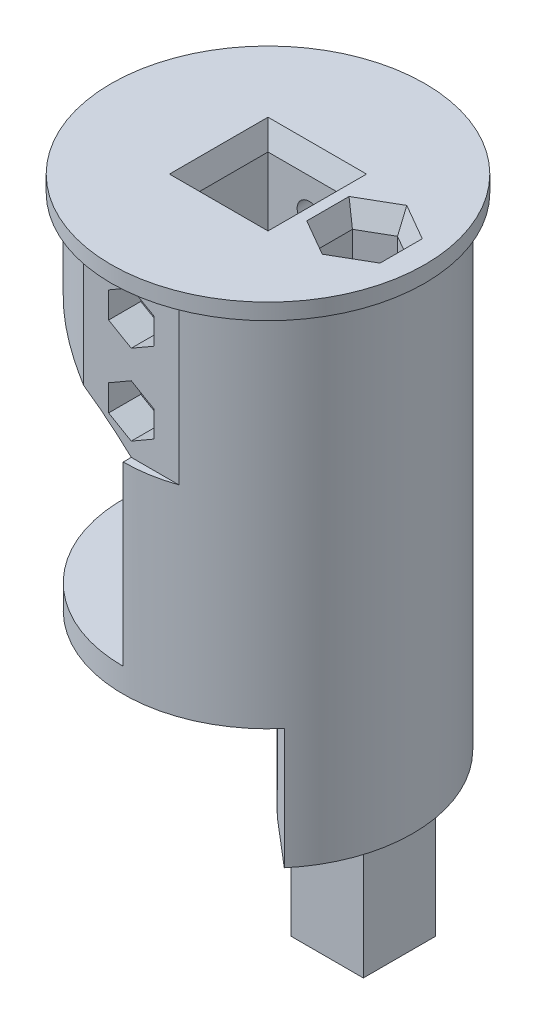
from build123d import *
from build123d.topology import SkipClean

# Parameters (mm, degrees)
SKETCH_1_R          = 18
EXTRUDE_1_DEPTH     = 45
SKETCH_2_R          = 19.5
EXTRUDE_2_DEPTH     = 2
SKETCH_3_W          = 10.25
SKETCH_3_H          = 10.25
CUT_EXTRUDE_1_DEPTH = 40
EXTRUDE_START       = 15
EXTRUDE_3_DEPTH     = 15
BOSS_EXTRUDE1_START = 20
SKETCH1_R           = 18
BOSS_EXTRUDE1_DEPTH = 20
BOSS_EXTRUDE2_START = 7
SKETCH3_R           = 18
BOSS_EXTRUDE2_DEPTH = 7
SKETCH4_W           = 10.2
SKETCH4_H           = 10.2
CUT_EXTRUDE2_DEPTH  = 27
CUT_EXTRUDE4_DEPTH  = 25
BOSS_EXTRUDE3_DEPTH = 3
SKETCH9_W           = 36
SKETCH9_H           = 22
CUT_EXTRUDE5_DEPTH  = 8
SKETCH10_R          = 3.7
SKETCH10_W          = 3
SKETCH10_H          = 2
CUT_EXTRUDE6_DEPTH  = 10
SKETCH11_R          = 2
CUT_EXTRUDE7_DEPTH  = 102
SKETCH15_R          = 18
CUT_EXTRUDE9_DEPTH  = 27
CUT_EXTRUDE11_DEPTH = 20
SKETCH18_R          = 1.5
CUT_EXTRUDE12_DEPTH = 63.62188116
SKETCH19_R          = 3
CUT_EXTRUDE13_DEPTH = 3
BOSS_EXTRUDE5_DEPTH = 22
CUT_EXTRUDE16_DEPTH = 4
CUT_EXTRUDE17_DEPTH = 6
CUT_EXTRUDE18_DEPTH = 63.62188116
FILLET2_R           = 5
SKETCH30_W          = 18.8
SKETCH30_H          = 10
CUT_EXTRUDE20_DEPTH = 3
CHAMFER1_SIZE       = 1
CHAMFER1_SIZE2      = 2.747477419
CHAMFER2_SIZE       = 1
CHAMFER2_SIZE2      = 2.747477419
BOSS_EXTRUDE7_START = 15
SKETCH37_W          = 9
SKETCH37_H          = 9
SKETCH37_R          = 2
BOSS_EXTRUDE7_DEPTH = 15
CUT_EXTRUDE22_DEPTH = 15
CUT_EXTRUDE23_REACH = 69.856
SKETCH40_W          = 4.363156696
SKETCH40_H          = 4.363156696
CUT_EXTRUDE24_DEPTH = 10
FILLET7_R           = 6


with BuildPart() as part:
    # Sketch 1 → Extrude 1 (new body)
    with BuildSketch(Plane(origin=(0, 0, 0), x_dir=(1, 0, 0), z_dir=(0, 1, 0))):
        with Locations(Location((0, 0, 0), (0, 0, 90))):
            Circle(SKETCH_1_R)
    extrude(amount=EXTRUDE_1_DEPTH)

    # Sketch 2 → Extrude 2 (add)
    with BuildSketch(Plane(origin=(0, 45, 0), x_dir=(1, 0, 0), z_dir=(0, 1, 0))):
        with Locations(Location((0, 0, 0), (0, 0, 270))):
            Circle(SKETCH_2_R)
    extrude(amount=EXTRUDE_2_DEPTH)

    # Sketch 3 → Cut-Extrude 1 (cut)
    with BuildSketch(Plane(origin=(0, 47, 0), x_dir=(1, 0, 0), z_dir=(0, 1, 0))):
        Rectangle(SKETCH_3_W, SKETCH_3_H)
    extrude(amount=-CUT_EXTRUDE_1_DEPTH, mode=Mode.SUBTRACT)

    # Sketch 4 → Extrude 3 (add)
    with BuildSketch(Plane.XZ.offset(EXTRUDE_START)):
        with BuildLine():
            Line((5.142300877, -6.128355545), (11.570176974, -13.788799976))
            ThreePointArc((11.570176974, -13.788799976), (17.937391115, -1.5), (13.69961987, 11.675633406))
            Line((13.69961987, 11.675633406), (5.142300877, 4.38257561))
            Line((5.142300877, 4.38257561), (5.142300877, -6.128355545))
        make_face()
    extrude(amount=-EXTRUDE_3_DEPTH)

    # Sketch1 → Boss-Extrude1 (add)
    with BuildSketch(Plane.XZ.offset(15).offset(BOSS_EXTRUDE1_START)):
        with Locations(Location((0, 0, 0), (0, 0, 270))):
            Circle(SKETCH1_R)
    extrude(amount=-BOSS_EXTRUDE1_DEPTH)

    # Sketch3 → Boss-Extrude2 (add)
    with BuildSketch(Plane.XZ.offset(35).offset(BOSS_EXTRUDE2_START)):
        with Locations(Location((0, 0, 0), (0, 0, 270))):
            Circle(SKETCH3_R)
    extrude(amount=-BOSS_EXTRUDE2_DEPTH)

    # Sketch4 → Cut-Extrude2 (cut)
    with BuildSketch(Plane.XZ.offset(42)):
        Rectangle(SKETCH4_W, SKETCH4_H)
    extrude(amount=-CUT_EXTRUDE2_DEPTH, mode=Mode.SUBTRACT)

    # Sketch6 → Cut-Extrude4 (cut)
    with BuildSketch(Plane.XZ):
        with BuildLine():
            Line((0, 18), (0, -18))
            ThreePointArc((0, -18), (-18, 0), (0, 18))
        make_face()
    extrude(amount=-CUT_EXTRUDE4_DEPTH, mode=Mode.SUBTRACT)

    # Sketch8 → Boss-Extrude3 (add)
    with BuildSketch(Plane.XZ):
        with BuildLine():
            Line((0, -18), (0, 18))
            ThreePointArc((0, 18), (-18, 0), (0, -18))
        make_face()
    extrude(amount=-BOSS_EXTRUDE3_DEPTH)

    # Sketch9 → Cut-Extrude5 (cut)
    with BuildSketch(Plane.ZY):
        with Locations((0, 14)):
            Rectangle(SKETCH9_W, SKETCH9_H)
    extrude(amount=-CUT_EXTRUDE5_DEPTH, mode=Mode.SUBTRACT)

    # Sketch10 → Cut-Extrude6 (cut)
    with BuildSketch(Plane.XZ):
        with Locations(Location((0, 0, 0), (0, 0, 270))):
            Circle(SKETCH10_R)
        with Locations((0, 7.7)):
            Rectangle(SKETCH10_W, SKETCH10_H)
    extrude(amount=-CUT_EXTRUDE6_DEPTH, mode=Mode.SUBTRACT)

    # Sketch11 → Cut-Extrude7 (cut)
    with BuildSketch(Plane.XZ.offset(42)):
        with Locations(Location((12, 0, 0), (0, 0, 270))):
            Circle(SKETCH11_R)
    extrude(amount=-CUT_EXTRUDE7_DEPTH, mode=Mode.SUBTRACT)

    # Sketch15 → Cut-Extrude9 (cut)
    with BuildSketch(Plane.XZ.offset(42)):
        with Locations(Location((0, 0, 0), (0, 0, 310))):
            Circle(SKETCH15_R)
    extrude(amount=-CUT_EXTRUDE9_DEPTH, mode=Mode.SUBTRACT)

    # Sketch17 → Cut-Extrude11 (cut)
    with BuildSketch(Plane.XZ.offset(-25)):
        with BuildLine():
            Line((5.916079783, -17), (-5.916079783, -17))
            ThreePointArc((-5.916079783, -17), (0, -18), (5.916079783, -17))
        make_face()
        with BuildLine():
            Line((5.916079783, 17), (-5.916079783, 17))
            ThreePointArc((-5.916079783, 17), (0, 18), (5.916079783, 17))
        make_face()
    extrude(amount=-CUT_EXTRUDE11_DEPTH, mode=Mode.SUBTRACT)

    # Sketch18 → Cut-Extrude12 (cut, through all)
    with BuildSketch(Plane.XY.offset(-17)):
        with Locations(Location((0, 30, 0), (0, 0, 180))):
            Circle(SKETCH18_R)
        with Locations(Location((0, 40, 0), (0, 0, 180))):
            Circle(SKETCH18_R)
    extrude(amount=CUT_EXTRUDE12_DEPTH, mode=Mode.SUBTRACT)

    # Sketch19 → Cut-Extrude13 (cut)
    with BuildSketch(Plane.XY.offset(-17)):
        with Locations((0, 30)):
            Circle(SKETCH19_R)
        with Locations((0, 40)):
            Circle(SKETCH19_R)
    extrude(amount=CUT_EXTRUDE13_DEPTH, mode=Mode.SUBTRACT)

    # Sketch23 → Boss-Extrude5 (add)
    with BuildSketch(Plane(origin=(0, 3, 0), x_dir=(1, 0, 0), z_dir=(0, 1, 0))):
        with BuildLine():
            Line((0, -14.4), (8, -14.4))
            Line((8, -14.4), (8, -16.124515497))
            ThreePointArc((8, -16.124515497), (4.108449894, -17.524857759), (0, -18))
            Line((0, -18), (0, -14.4))
        make_face()
        with BuildLine():
            Line((0, 14.4), (8, 14.4))
            Line((8, 14.4), (8, 16.124515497))
            ThreePointArc((8, 16.124515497), (4.108449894, 17.524857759), (0, 18))
            Line((0, 18), (0, 14.4))
        make_face()
    extrude(amount=BOSS_EXTRUDE5_DEPTH)

    # Sketch25 → Cut-Extrude16 (cut)
    with BuildSketch(Plane.XY.offset(17)):
        Polygon((-2.814582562, 28.375), (0, 26.75), (2.814582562, 28.375), (2.814582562, 31.625), (0, 33.25), (-2.814582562, 31.625), align=None)
        Polygon((-2.814582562, 41.625), (-2.814582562, 38.375), (0, 36.75), (2.814582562, 38.375), (2.814582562, 41.625), (0, 43.25), align=None)
    extrude(amount=-CUT_EXTRUDE16_DEPTH, mode=Mode.SUBTRACT)

    # Sketch26 → Cut-Extrude17 (cut)
    with BuildSketch(Plane(origin=(0, 47, 0), x_dir=(1, 0, 0), z_dir=(0, 1, 0))):
        Polygon((8.449295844, -2.05), (12, -4.1), (15.550704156, -2.05), (15.550704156, 2.05), (12, 4.1), (8.449295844, 2.05), align=None)
    extrude(amount=-CUT_EXTRUDE17_DEPTH, mode=Mode.SUBTRACT)

    # Sketch27 → Cut-Extrude18 (cut, through all)
    with BuildSketch(Plane.XY.offset(17)):
        with BuildLine():
            Line((-20, 36.547005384), (-20, 25))
            Line((-20, 25), (0, 25))
            ThreePointArc((0, 25), (-9.324199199, 31.944024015), (-20, 36.547005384))
        make_face()
    extrude(amount=-CUT_EXTRUDE18_DEPTH, mode=Mode.SUBTRACT)

    # Fillet2
    fillet2_edges = [part.edges().sort_by_distance(p)[0] for p in [
        (8, 14, -14.4),
        (8, 14, 14.4),
    ]]
    fillet(fillet2_edges, radius=FILLET2_R)

    # Sketch30 → Cut-Extrude20 (cut)
    with SkipClean():  # the faces are left unmerged after this step: merging them gives an invalid solid
        with BuildSketch(Plane.ZY.offset(-8)):
            with Locations((0, 8)):
                Rectangle(SKETCH30_W, SKETCH30_H)
        extrude(amount=-CUT_EXTRUDE20_DEPTH, mode=Mode.SUBTRACT)

    # Chamfer1
    chamfer1_edges = [part.edges().sort_by_distance(p)[0] for p in [
        (5.125, 47, 0),
        (0, 47, -5.125),
        (-5.125, 47, 0),
        (0, 47, 5.125),
    ]]
    chamfer1_side = [part.faces().sort_by_distance(p)[0] for p in [
        (0, 47, -18.948456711),
    ]]
    chamfer(chamfer1_edges, length=CHAMFER1_SIZE, length2=CHAMFER1_SIZE2, reference=chamfer1_side[0])

    # Chamfer2
    chamfer2_edges = [part.edges().sort_by_distance(p)[0] for p in [
        (8.449295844, 47, 0),
        (10.224647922, 47, 3.075),
        (13.775352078, 47, 3.075),
        (15.550704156, 47, 0),
        (13.775352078, 47, -3.075),
        (10.224647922, 47, -3.075),
    ]]
    chamfer2_side = [part.faces().sort_by_distance(p)[0] for p in [
        (6.676543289, 47, 0),
    ]]
    chamfer(chamfer2_edges, length=CHAMFER2_SIZE, length2=CHAMFER2_SIZE2, reference=chamfer2_side[0])

    # Sketch37 → Boss-Extrude7 (add)
    with SkipClean():  # the faces are left unmerged after this step: merging them gives an invalid solid
        with BuildSketch(Plane.XZ.offset(15).offset(BOSS_EXTRUDE7_START)):
            with Locations((10.978822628, -0.872889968)):
                Rectangle(SKETCH37_W, SKETCH37_H)
            with Locations(Location((12, 0, 0), (0, 0, 270))):
                Circle(SKETCH37_R, mode=Mode.SUBTRACT)
        extrude(amount=-BOSS_EXTRUDE7_DEPTH)

    # Sketch38 → Cut-Extrude22 (cut)
    with SkipClean():  # the faces are left unmerged after this step: merging them gives an invalid solid
        with BuildSketch(Plane.XZ.offset(15)):
            with BuildLine():
                Line((5.142300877, -6.128355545), (5.142300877, 4.38257561))
                ThreePointArc((5.142300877, 4.38257561), (5.978822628, -0.872889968), (5.142300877, -6.128355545))
            make_face()
        extrude(amount=-CUT_EXTRUDE22_DEPTH, mode=Mode.SUBTRACT)

    # Cut-Extrude23: up to this face of the body (flat: up to its plane)
    cut_extrude23_end = Plane(part.part.faces().sort_by_distance((9.450359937, 13, 0))[0])
    # Sketch39 → Cut-Extrude23 (cut, up to the picked face)
    with BuildSketch(Plane.XZ.offset(15), mode=Mode.PRIVATE) as cut_extrude23_sk1:
        with BuildLine():
            Line((7.420733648, -7.372889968), (15.420733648, -7.372889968))
            ThreePointArc((15.420733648, -7.372889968), (13.728515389, -10.030415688), (11.598853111, -12.352178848))
            Line((11.598853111, -12.352178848), (7.420733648, -7.372889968))
        make_face()
    cut_extrude23_tool1 = split(extrude(cut_extrude23_sk1.sketch, amount=-CUT_EXTRUDE23_REACH, mode=Mode.PRIVATE), bisect_by=cut_extrude23_end, keep=Keep.BOTH, mode=Mode.PRIVATE)
    add(cut_extrude23_tool1.solids().sort_by(Axis((11.596211, -15, -9.081847), (0, 1, 0)))[0], mode=Mode.SUBTRACT)

    # Sketch40 → Cut-Extrude24 (cut)
    with SkipClean():  # the faces are left unmerged after this step: merging them gives an invalid solid
        with BuildSketch(Plane(origin=(0, 3, 0), x_dir=(1, 0, 0), z_dir=(0, 1, 0))):
            with Locations((9.602311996, 9.554468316)):
                Rectangle(SKETCH40_W, SKETCH40_H)
        extrude(amount=CUT_EXTRUDE24_DEPTH, mode=Mode.SUBTRACT)

    # Fillet7
    fillet7_edges = [part.edges().sort_by_distance(p)[0] for p in [
        (5.142300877, -7.5, 4.38257561),
        (5.142300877, -7.5, -6.128355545),
    ]]
    fillet(fillet7_edges, radius=FILLET7_R)


solid = part.part
